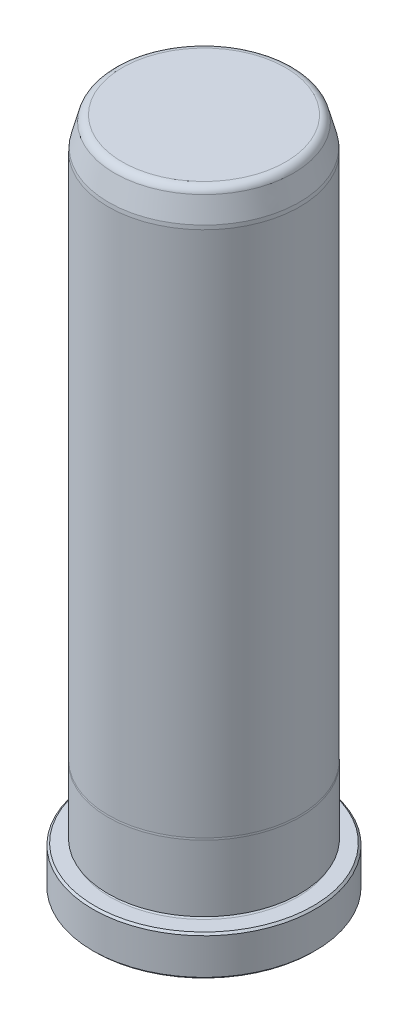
ISO-10303-21;
HEADER;
FILE_DESCRIPTION(('STEP AP214'),'2;1');
FILE_NAME('part.step','',(''),(''),'','','');
FILE_SCHEMA(('AUTOMOTIVE_DESIGN { 1 0 10303 214 1 1 1 1 }'));
ENDSEC;
DATA;
#1=APPLICATION_CONTEXT('core data for automotive mechanical design processes');
#2=APPLICATION_PROTOCOL_DEFINITION('international standard','automotive_design',2000,#1);
#3=PRODUCT_CONTEXT('',#1,'mechanical');
#4=PRODUCT('Part','Part','',(#3));
#5=PRODUCT_RELATED_PRODUCT_CATEGORY('part','',(#4));
#6=PRODUCT_DEFINITION_FORMATION('','',#4);
#7=PRODUCT_DEFINITION_CONTEXT('part definition',#1,'design');
#8=PRODUCT_DEFINITION('design','',#6,#7);
#9=PRODUCT_DEFINITION_SHAPE('','',#8);
#10=(LENGTH_UNIT() NAMED_UNIT(*) SI_UNIT(.MILLI.,.METRE.));
#11=(NAMED_UNIT(*) PLANE_ANGLE_UNIT() SI_UNIT($,.RADIAN.));
#12=(NAMED_UNIT(*) SI_UNIT($,.STERADIAN.) SOLID_ANGLE_UNIT());
#13=UNCERTAINTY_MEASURE_WITH_UNIT(LENGTH_MEASURE(1.E-05),#10,'distance_accuracy_value','');
#14=(GEOMETRIC_REPRESENTATION_CONTEXT(3) GLOBAL_UNCERTAINTY_ASSIGNED_CONTEXT((#13)) GLOBAL_UNIT_ASSIGNED_CONTEXT((#10,
#11,#12)) REPRESENTATION_CONTEXT('',''));
#15=CARTESIAN_POINT('',(0.,0.,0.));
#16=DIRECTION('',(0.,0.,1.));
#17=DIRECTION('',(1.,0.,0.));
#18=AXIS2_PLACEMENT_3D('',#15,#16,#17);
#19=CARTESIAN_POINT('',(0.,-1.15498161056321E-13,0.));
#20=DIRECTION('',(0.,1.,0.));
#21=DIRECTION('',(0.,0.,1.));
#22=AXIS2_PLACEMENT_3D('',#19,#20,#21);
#23=PLANE('',#22);
#24=CARTESIAN_POINT('',(0.,-1.15498161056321E-13,0.));
#25=DIRECTION('',(0.,1.,0.));
#26=DIRECTION('',(0.,0.,1.));
#27=AXIS2_PLACEMENT_3D('',#24,#25,#26);
#28=CIRCLE('',#27,21.7170000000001);
#29=CARTESIAN_POINT('',(0.,-3.42511787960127E-13,21.7170000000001));
#30=VERTEX_POINT('',#29);
#31=EDGE_CURVE('E37',#30,#30,#28,.F.);
#32=ORIENTED_EDGE('',*,*,#31,.T.);
#33=EDGE_LOOP('',(#32));
#34=FACE_BOUND('',#33,.T.);
#35=ADVANCED_FACE('F30',(#34),#23,.F.);
#36=CARTESIAN_POINT('',(0.,0.,0.));
#37=DIRECTION('',(0.,1.,0.));
#38=DIRECTION('',(0.,0.,1.));
#39=AXIS2_PLACEMENT_3D('',#36,#37,#38);
#40=CYLINDRICAL_SURFACE('',#39,22.098);
#41=CARTESIAN_POINT('',(0.,0.380999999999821,0.));
#42=DIRECTION('',(0.,1.,0.));
#43=DIRECTION('',(0.,0.,1.));
#44=AXIS2_PLACEMENT_3D('',#41,#42,#43);
#45=CIRCLE('',#44,22.098);
#46=CARTESIAN_POINT('',(0.,0.38099999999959,22.098));
#47=VERTEX_POINT('',#46);
#48=EDGE_CURVE('E41',#47,#47,#45,.T.);
#49=ORIENTED_EDGE('',*,*,#48,.T.);
#50=EDGE_LOOP('',(#49));
#51=FACE_BOUND('',#50,.T.);
#52=CARTESIAN_POINT('',(0.,7.54379999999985,0.));
#53=DIRECTION('',(0.,-1.,0.));
#54=DIRECTION('',(0.,0.,-1.));
#55=AXIS2_PLACEMENT_3D('',#52,#53,#54);
#56=CIRCLE('',#55,22.098);
#57=CARTESIAN_POINT('',(0.,7.54380000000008,-22.098));
#58=VERTEX_POINT('',#57);
#59=EDGE_CURVE('E45',#58,#58,#56,.T.);
#60=ORIENTED_EDGE('',*,*,#59,.T.);
#61=EDGE_LOOP('',(#60));
#62=FACE_BOUND('',#61,.T.);
#63=ADVANCED_FACE('F118',(#51,#62),#40,.T.);
#64=CARTESIAN_POINT('',(0.,7.92480000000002,-22.098));
#65=DIRECTION('',(0.,-1.,0.));
#66=DIRECTION('',(0.,0.,-1.));
#67=AXIS2_PLACEMENT_3D('',#64,#65,#66);
#68=PLANE('',#67);
#69=CARTESIAN_POINT('',(0.,7.92479999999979,0.));
#70=DIRECTION('',(0.,-1.,0.));
#71=DIRECTION('',(0.,0.,-1.));
#72=AXIS2_PLACEMENT_3D('',#69,#70,#71);
#73=CIRCLE('',#72,21.7170000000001);
#74=CARTESIAN_POINT('',(0.,7.92480000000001,-21.717));
#75=VERTEX_POINT('',#74);
#76=EDGE_CURVE('E10',#75,#75,#73,.F.);
#77=ORIENTED_EDGE('',*,*,#76,.T.);
#78=EDGE_LOOP('',(#77));
#79=FACE_BOUND('',#78,.T.);
#80=CARTESIAN_POINT('',(0.,7.9247999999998,0.));
#81=DIRECTION('',(0.,1.,0.));
#82=DIRECTION('',(0.,0.,1.));
#83=AXIS2_PLACEMENT_3D('',#80,#81,#82);
#84=CIRCLE('',#83,18.6563000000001);
#85=CARTESIAN_POINT('',(0.,7.92479999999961,18.6563000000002));
#86=VERTEX_POINT('',#85);
#87=EDGE_CURVE('E56',#86,#86,#84,.T.);
#88=ORIENTED_EDGE('',*,*,#87,.F.);
#89=EDGE_LOOP('',(#88));
#90=FACE_BOUND('',#89,.T.);
#91=ADVANCED_FACE('F113',(#79,#90),#68,.F.);
#92=CARTESIAN_POINT('',(0.,8.30579999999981,0.));
#93=DIRECTION('',(0.,1.,0.));
#94=DIRECTION('',(0.,0.,1.));
#95=AXIS2_PLACEMENT_3D('',#92,#93,#94);
#96=TOROIDAL_SURFACE('',#95,18.6563000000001,0.381);
#97=CARTESIAN_POINT('',(0.,8.68679999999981,0.));
#98=DIRECTION('',(0.,1.,0.));
#99=DIRECTION('',(0.,0.,1.));
#100=AXIS2_PLACEMENT_3D('',#97,#98,#99);
#101=CIRCLE('',#100,18.6563000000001);
#102=CARTESIAN_POINT('',(0.,8.68679999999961,18.6563000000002));
#103=VERTEX_POINT('',#102);
#104=EDGE_CURVE('E59',#103,#103,#101,.T.);
#105=ORIENTED_EDGE('',*,*,#104,.F.);
#106=EDGE_LOOP('',(#105));
#107=FACE_BOUND('',#106,.T.);
#108=ORIENTED_EDGE('',*,*,#87,.T.);
#109=EDGE_LOOP('',(#108));
#110=FACE_BOUND('',#109,.T.);
#111=ADVANCED_FACE('F107',(#107,#110),#96,.F.);
#112=CARTESIAN_POINT('',(0.,8.6868,-18.6563));
#113=DIRECTION('',(0.,1.,0.));
#114=DIRECTION('',(0.,0.,1.));
#115=AXIS2_PLACEMENT_3D('',#112,#113,#114);
#116=PLANE('',#115);
#117=CARTESIAN_POINT('',(0.,8.6867999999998,0.));
#118=DIRECTION('',(0.,1.,0.));
#119=DIRECTION('',(0.,0.,1.));
#120=AXIS2_PLACEMENT_3D('',#117,#118,#119);
#121=CIRCLE('',#120,19.0627000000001);
#122=CARTESIAN_POINT('',(0.,8.6867999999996,19.0627000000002));
#123=VERTEX_POINT('',#122);
#124=EDGE_CURVE('E62',#123,#123,#121,.T.);
#125=ORIENTED_EDGE('',*,*,#124,.F.);
#126=EDGE_LOOP('',(#125));
#127=FACE_BOUND('',#126,.T.);
#128=ORIENTED_EDGE('',*,*,#104,.T.);
#129=EDGE_LOOP('',(#128));
#130=FACE_BOUND('',#129,.T.);
#131=ADVANCED_FACE('F101',(#127,#130),#116,.F.);
#132=CARTESIAN_POINT('',(0.,0.,0.));
#133=DIRECTION('',(0.,1.,0.));
#134=DIRECTION('',(0.,0.,1.));
#135=AXIS2_PLACEMENT_3D('',#132,#133,#134);
#136=CYLINDRICAL_SURFACE('',#135,19.0627000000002);
#137=CARTESIAN_POINT('',(0.,21.8617630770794,2.28526874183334E-13));
#138=DIRECTION('',(0.,1.,0.));
#139=DIRECTION('',(0.,0.,1.));
#140=AXIS2_PLACEMENT_3D('',#137,#138,#139);
#141=CIRCLE('',#140,19.0627000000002);
#142=CARTESIAN_POINT('',(0.,21.8617630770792,19.0627000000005));
#143=VERTEX_POINT('',#142);
#144=EDGE_CURVE('E65',#143,#143,#141,.T.);
#145=ORIENTED_EDGE('',*,*,#144,.F.);
#146=EDGE_LOOP('',(#145));
#147=FACE_BOUND('',#146,.T.);
#148=ORIENTED_EDGE('',*,*,#124,.T.);
#149=EDGE_LOOP('',(#148));
#150=FACE_BOUND('',#149,.T.);
#151=ADVANCED_FACE('F95',(#147,#150),#136,.T.);
#152=CARTESIAN_POINT('',(0.,21.8617630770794,2.28526874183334E-13));
#153=DIRECTION('',(0.,-1.,0.));
#154=DIRECTION('',(0.,0.,-1.));
#155=AXIS2_PLACEMENT_3D('',#152,#153,#154);
#156=CONICAL_SURFACE('',#155,19.0627000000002,0.0698131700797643);
#157=CARTESIAN_POINT('',(0.,22.2249999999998,2.32323887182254E-13));
#158=DIRECTION('',(0.,1.,0.));
#159=DIRECTION('',(0.,0.,1.));
#160=AXIS2_PLACEMENT_3D('',#157,#158,#159);
#161=CIRCLE('',#160,19.0373000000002);
#162=CARTESIAN_POINT('',(0.,22.2249999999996,19.0373000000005));
#163=VERTEX_POINT('',#162);
#164=EDGE_CURVE('E68',#163,#163,#161,.T.);
#165=ORIENTED_EDGE('',*,*,#164,.F.);
#166=EDGE_LOOP('',(#165));
#167=FACE_BOUND('',#166,.T.);
#168=ORIENTED_EDGE('',*,*,#144,.T.);
#169=EDGE_LOOP('',(#168));
#170=FACE_BOUND('',#169,.T.);
#171=ADVANCED_FACE('F89',(#167,#170),#156,.T.);
#172=CARTESIAN_POINT('',(0.,0.,0.));
#173=DIRECTION('',(0.,1.,0.));
#174=DIRECTION('',(0.,0.,1.));
#175=AXIS2_PLACEMENT_3D('',#172,#173,#174);
#176=CYLINDRICAL_SURFACE('',#175,19.0373000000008);
#177=CARTESIAN_POINT('',(0.,127.,1.32756506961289E-12));
#178=DIRECTION('',(0.,1.,0.));
#179=DIRECTION('',(0.,0.,1.));
#180=AXIS2_PLACEMENT_3D('',#177,#178,#179);
#181=CIRCLE('',#180,19.0373000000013);
#182=CARTESIAN_POINT('',(0.,127.,19.0373000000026));
#183=VERTEX_POINT('',#182);
#184=EDGE_CURVE('E71',#183,#183,#181,.T.);
#185=ORIENTED_EDGE('',*,*,#184,.F.);
#186=EDGE_LOOP('',(#185));
#187=FACE_BOUND('',#186,.T.);
#188=ORIENTED_EDGE('',*,*,#164,.T.);
#189=EDGE_LOOP('',(#188));
#190=FACE_BOUND('',#189,.T.);
#191=ADVANCED_FACE('F83',(#187,#190),#176,.T.);
#192=CARTESIAN_POINT('',(0.,127.,1.32756506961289E-12));
#193=DIRECTION('',(0.,-1.,0.));
#194=DIRECTION('',(0.,0.,-1.));
#195=AXIS2_PLACEMENT_3D('',#192,#193,#194);
#196=CONICAL_SURFACE('',#195,19.0373000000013,0.0872664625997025);
#197=CARTESIAN_POINT('',(0.,127.762,1.33553046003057E-12));
#198=DIRECTION('',(0.,1.,0.));
#199=DIRECTION('',(0.,0.,1.));
#200=AXIS2_PLACEMENT_3D('',#197,#198,#199);
#201=CIRCLE('',#200,18.9706336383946);
#202=CARTESIAN_POINT('',(0.,127.762,18.9706336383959));
#203=VERTEX_POINT('',#202);
#204=EDGE_CURVE('E74',#203,#203,#201,.T.);
#205=ORIENTED_EDGE('',*,*,#204,.F.);
#206=EDGE_LOOP('',(#205));
#207=FACE_BOUND('',#206,.T.);
#208=ORIENTED_EDGE('',*,*,#184,.T.);
#209=EDGE_LOOP('',(#208));
#210=FACE_BOUND('',#209,.T.);
#211=ADVANCED_FACE('F80',(#207,#210),#196,.T.);
#212=CARTESIAN_POINT('',(0.,127.762,1.33553046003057E-12));
#213=DIRECTION('',(0.,-1.,0.));
#214=DIRECTION('',(0.,0.,-1.));
#215=AXIS2_PLACEMENT_3D('',#212,#213,#214);
#216=CONICAL_SURFACE('',#215,18.9706336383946,0.26179938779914);
#217=CARTESIAN_POINT('',(0.,132.1733752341,1.38164374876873E-12));
#218=DIRECTION('',(0.,1.,0.));
#219=DIRECTION('',(0.,0.,1.));
#220=AXIS2_PLACEMENT_3D('',#217,#218,#219);
#221=CIRCLE('',#220,17.7886092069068);
#222=CARTESIAN_POINT('',(0.,132.1733752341,17.7886092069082));
#223=VERTEX_POINT('',#222);
#224=EDGE_CURVE('E50',#223,#223,#221,.F.);
#225=ORIENTED_EDGE('',*,*,#224,.T.);
#226=EDGE_LOOP('',(#225));
#227=FACE_BOUND('',#226,.T.);
#228=ORIENTED_EDGE('',*,*,#204,.T.);
#229=EDGE_LOOP('',(#228));
#230=FACE_BOUND('',#229,.T.);
#231=ADVANCED_FACE('F78',(#227,#230),#216,.T.);
#232=CARTESIAN_POINT('',(0.,133.35,-17.4733335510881));
#233=DIRECTION('',(0.,-1.,0.));
#234=DIRECTION('',(0.,0.,-1.));
#235=AXIS2_PLACEMENT_3D('',#232,#233,#234);
#236=PLANE('',#235);
#237=CARTESIAN_POINT('',(0.,133.35,1.39394332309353E-12));
#238=DIRECTION('',(0.,-1.,0.));
#239=DIRECTION('',(0.,0.,-1.));
#240=AXIS2_PLACEMENT_3D('',#237,#238,#239);
#241=CIRCLE('',#240,16.2552019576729);
#242=CARTESIAN_POINT('',(0.,133.35,-16.2552019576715));
#243=VERTEX_POINT('',#242);
#244=EDGE_CURVE('E53',#243,#243,#241,.F.);
#245=ORIENTED_EDGE('',*,*,#244,.T.);
#246=EDGE_LOOP('',(#245));
#247=FACE_BOUND('',#246,.T.);
#248=ADVANCED_FACE('F133',(#247),#236,.F.);
#249=CARTESIAN_POINT('',(0.,131.7625,1.37734875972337E-12));
#250=DIRECTION('',(0.,-1.,0.));
#251=DIRECTION('',(0.,0.,-1.));
#252=AXIS2_PLACEMENT_3D('',#249,#250,#251);
#253=TOROIDAL_SURFACE('',#252,16.2552019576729,1.5875);
#254=ORIENTED_EDGE('',*,*,#224,.F.);
#255=EDGE_LOOP('',(#254));
#256=FACE_BOUND('',#255,.T.);
#257=ORIENTED_EDGE('',*,*,#244,.F.);
#258=EDGE_LOOP('',(#257));
#259=FACE_BOUND('',#258,.T.);
#260=ADVANCED_FACE('F130',(#256,#259),#253,.T.);
#261=CARTESIAN_POINT('',(0.,0.380999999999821,0.));
#262=DIRECTION('',(0.,1.,0.));
#263=DIRECTION('',(0.,0.,1.));
#264=AXIS2_PLACEMENT_3D('',#261,#262,#263);
#265=CONICAL_SURFACE('',#264,22.098,0.785398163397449);
#266=ORIENTED_EDGE('',*,*,#31,.F.);
#267=EDGE_LOOP('',(#266));
#268=FACE_BOUND('',#267,.T.);
#269=ORIENTED_EDGE('',*,*,#48,.F.);
#270=EDGE_LOOP('',(#269));
#271=FACE_BOUND('',#270,.T.);
#272=ADVANCED_FACE('F132',(#268,#271),#265,.T.);
#273=CARTESIAN_POINT('',(0.,7.92479999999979,0.));
#274=DIRECTION('',(0.,-1.,0.));
#275=DIRECTION('',(0.,0.,-1.));
#276=AXIS2_PLACEMENT_3D('',#273,#274,#275);
#277=CONICAL_SURFACE('',#276,21.7170000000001,0.785398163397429);
#278=ORIENTED_EDGE('',*,*,#59,.F.);
#279=EDGE_LOOP('',(#278));
#280=FACE_BOUND('',#279,.T.);
#281=ORIENTED_EDGE('',*,*,#76,.F.);
#282=EDGE_LOOP('',(#281));
#283=FACE_BOUND('',#282,.T.);
#284=ADVANCED_FACE('F32',(#280,#283),#277,.T.);
#285=CLOSED_SHELL('',(#35,#63,#91,#111,#131,#151,#171,#191,#211,#231,#248,#260,#272,#284));
#286=MANIFOLD_SOLID_BREP('B2',#285);
#287=ADVANCED_BREP_SHAPE_REPRESENTATION('',(#18,#286),#14);
#288=SHAPE_DEFINITION_REPRESENTATION(#9,#287);
ENDSEC;
END-ISO-10303-21;
